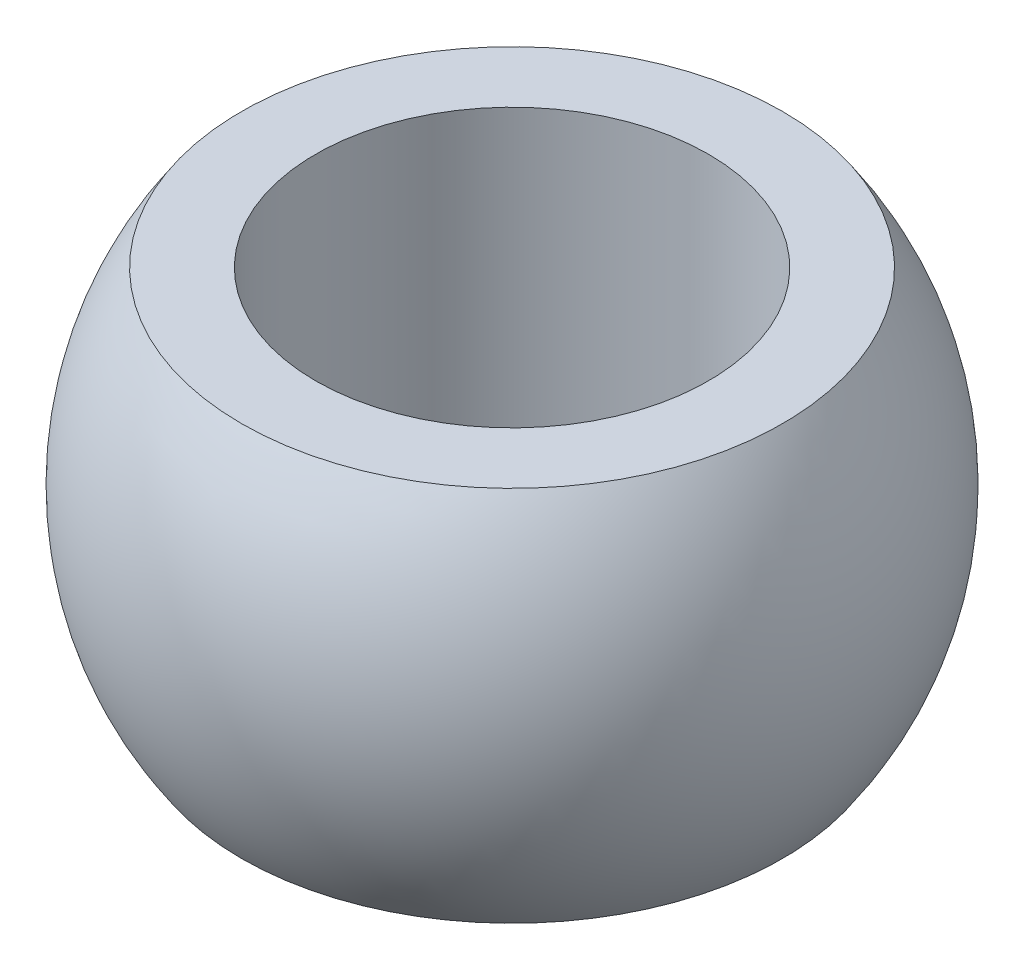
from build123d import *


with BuildPart() as part:
    # Esquisse1 → Base-R_volution (revolve)
    with BuildSketch(Plane.XY, mode=Mode.PRIVATE) as base_r_volution_sk:
        with BuildLine():
            Line((-20.105969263, 14), (-14.6, 14))
            Line((-14.6, 14), (-14.6, -14))
            Line((-14.6, -14), (-20.105969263, -14))
            ThreePointArc((-20.105969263, -14), (-24.5, 0), (-20.105969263, 14))
        make_face()
    revolve(base_r_volution_sk.sketch.rotate(Axis((0, 20.701831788, 0), (0, -1, 0)), 270), axis=Axis((0, 20.701831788, 0), (0, -1, 0)))


solid = part.part
